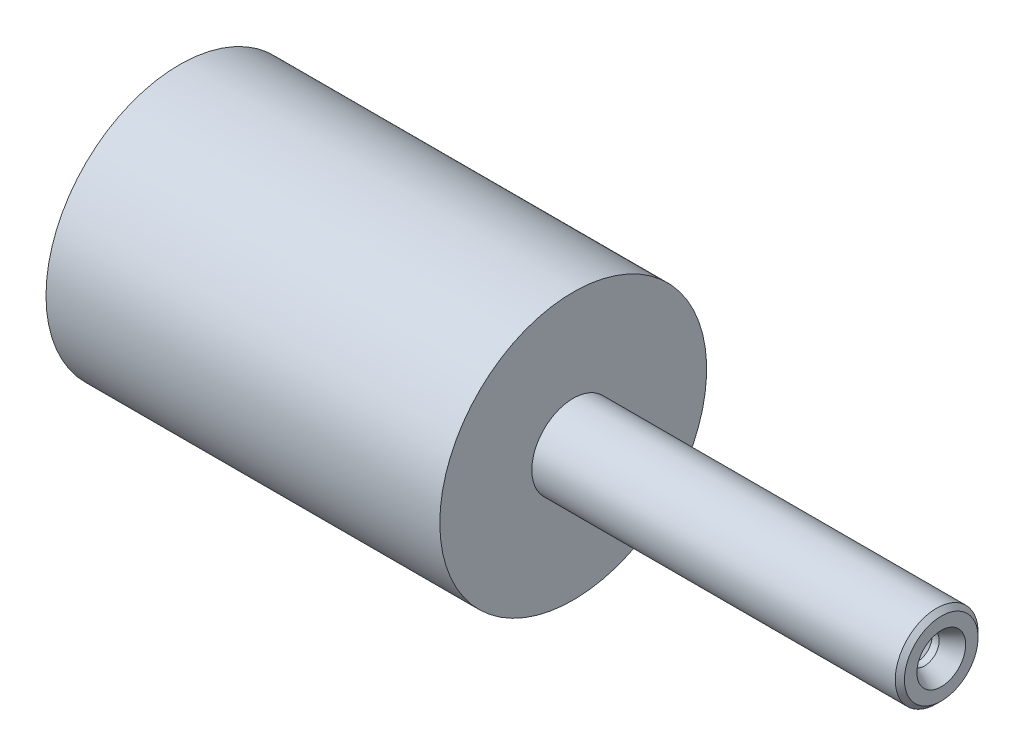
from build123d import *

# Parameters (mm, degrees)
ESQUISSE3_R      = 4.5
EXTRUSION1_DEPTH = 20
ESQUISSE4_R      = 14.5
EXTRUSION2_DEPTH = 42.8


with BuildPart() as part:
    # Esquisse1 → R_volution1 (revolve)
    with BuildSketch(Plane.XY, mode=Mode.PRIVATE) as r_volution1_sk:
        Polygon((0, 0), (0, 4.5), (19.5, 4.5), (20, 4), (20, 0), align=None)
    revolve(r_volution1_sk.sketch.rotate(Axis((20, 0, 0), (-1, 0, 0)), 270), axis=Axis((20, 0, 0), (-1, 0, 0)))

    # Esquisse2 → Enl_vement de mati_re-R_volution1 (revolve, cut)
    with BuildSketch(Plane.XY, mode=Mode.PRIVATE) as enl_vement_de_mati_re_r_volution1_sk:
        Polygon((7.290147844, 0), (8, 1.2295), (17.0295, 1.2295), (17.4, 1.6), (18.181346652, 1.6), (20, 2.65), (20, 0), align=None)
    revolve(enl_vement_de_mati_re_r_volution1_sk.sketch.rotate(Axis((20, 0, 0), (-1, 0, 0)), 270), axis=Axis((20, 0, 0), (-1, 0, 0)), mode=Mode.SUBTRACT)

    # Esquisse3 → Extrusion1 (add)
    with BuildSketch(Plane.ZY):
        Circle(ESQUISSE3_R)
    extrude(amount=EXTRUSION1_DEPTH)

    # Esquisse4 → Extrusion2 (add)
    with BuildSketch(Plane.ZY.offset(20)):
        Circle(ESQUISSE4_R)
    extrude(amount=EXTRUSION2_DEPTH)


solid = part.part
